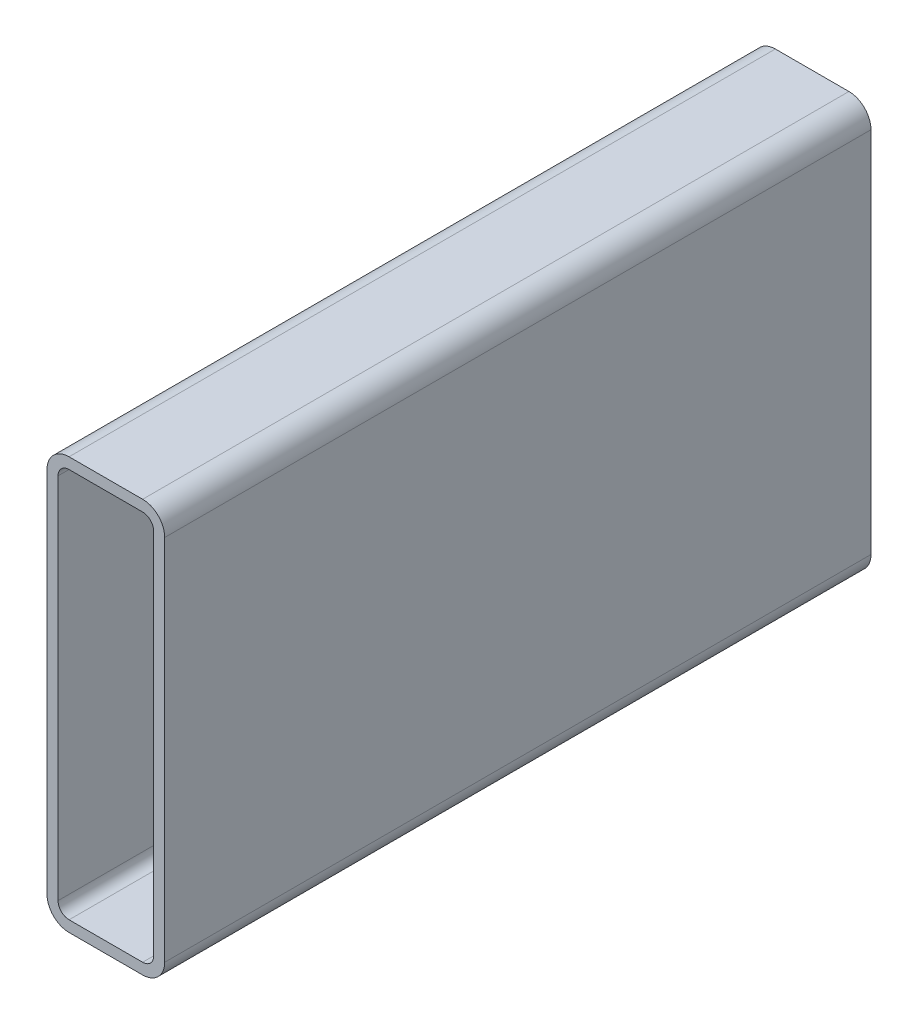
ISO-10303-21;
HEADER;
FILE_DESCRIPTION(('STEP AP214'),'2;1');
FILE_NAME('part.step','',(''),(''),'','','');
FILE_SCHEMA(('AUTOMOTIVE_DESIGN { 1 0 10303 214 1 1 1 1 }'));
ENDSEC;
DATA;
#1=APPLICATION_CONTEXT('core data for automotive mechanical design processes');
#2=APPLICATION_PROTOCOL_DEFINITION('international standard','automotive_design',2000,#1);
#3=PRODUCT_CONTEXT('',#1,'mechanical');
#4=PRODUCT('Part','Part','',(#3));
#5=PRODUCT_RELATED_PRODUCT_CATEGORY('part','',(#4));
#6=PRODUCT_DEFINITION_FORMATION('','',#4);
#7=PRODUCT_DEFINITION_CONTEXT('part definition',#1,'design');
#8=PRODUCT_DEFINITION('design','',#6,#7);
#9=PRODUCT_DEFINITION_SHAPE('','',#8);
#10=(LENGTH_UNIT() NAMED_UNIT(*) SI_UNIT(.MILLI.,.METRE.));
#11=(NAMED_UNIT(*) PLANE_ANGLE_UNIT() SI_UNIT($,.RADIAN.));
#12=(NAMED_UNIT(*) SI_UNIT($,.STERADIAN.) SOLID_ANGLE_UNIT());
#13=UNCERTAINTY_MEASURE_WITH_UNIT(LENGTH_MEASURE(1.E-05),#10,'distance_accuracy_value','');
#14=(GEOMETRIC_REPRESENTATION_CONTEXT(3) GLOBAL_UNCERTAINTY_ASSIGNED_CONTEXT((#13)) GLOBAL_UNIT_ASSIGNED_CONTEXT((#10,
#11,#12)) REPRESENTATION_CONTEXT('',''));
#15=CARTESIAN_POINT('',(0.,0.,0.));
#16=DIRECTION('',(0.,0.,1.));
#17=DIRECTION('',(1.,0.,0.));
#18=AXIS2_PLACEMENT_3D('',#15,#16,#17);
#19=CARTESIAN_POINT('',(9.52500000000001,168.275,304.8));
#20=DIRECTION('',(0.,0.,1.));
#21=DIRECTION('',(1.,0.,0.));
#22=AXIS2_PLACEMENT_3D('',#19,#20,#21);
#23=PLANE('',#22);
#24=CARTESIAN_POINT('',(9.52500000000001,168.275,304.8));
#25=DIRECTION('',(0.,0.,1.));
#26=DIRECTION('',(1.,0.,0.));
#27=AXIS2_PLACEMENT_3D('',#24,#25,#26);
#28=CIRCLE('',#27,9.52500000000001);
#29=CARTESIAN_POINT('',(9.525,177.8,304.8));
#30=VERTEX_POINT('',#29);
#31=CARTESIAN_POINT('',(0.,168.275,304.8));
#32=VERTEX_POINT('',#31);
#33=EDGE_CURVE('E211',#30,#32,#28,.T.);
#34=ORIENTED_EDGE('',*,*,#33,.T.);
#35=DIRECTION('',(0.,-1.,0.));
#36=VECTOR('',#35,1.);
#37=CARTESIAN_POINT('',(0.,9.525,304.8));
#38=LINE('',#37,#36);
#39=CARTESIAN_POINT('',(0.,9.525,304.8));
#40=VERTEX_POINT('',#39);
#41=EDGE_CURVE('E214',#32,#40,#38,.T.);
#42=ORIENTED_EDGE('',*,*,#41,.T.);
#43=CARTESIAN_POINT('',(9.525,9.525,304.8));
#44=DIRECTION('',(0.,0.,1.));
#45=DIRECTION('',(1.,0.,0.));
#46=AXIS2_PLACEMENT_3D('',#43,#44,#45);
#47=CIRCLE('',#46,9.525);
#48=CARTESIAN_POINT('',(9.525,0.,304.8));
#49=VERTEX_POINT('',#48);
#50=EDGE_CURVE('E217',#40,#49,#47,.T.);
#51=ORIENTED_EDGE('',*,*,#50,.T.);
#52=DIRECTION('',(1.,0.,0.));
#53=VECTOR('',#52,1.);
#54=CARTESIAN_POINT('',(41.275,0.,304.8));
#55=LINE('',#54,#53);
#56=CARTESIAN_POINT('',(41.275,0.,304.8));
#57=VERTEX_POINT('',#56);
#58=EDGE_CURVE('E219',#49,#57,#55,.T.);
#59=ORIENTED_EDGE('',*,*,#58,.T.);
#60=CARTESIAN_POINT('',(41.275,9.525,304.8));
#61=DIRECTION('',(0.,0.,1.));
#62=DIRECTION('',(1.,0.,0.));
#63=AXIS2_PLACEMENT_3D('',#60,#61,#62);
#64=CIRCLE('',#63,9.525);
#65=CARTESIAN_POINT('',(50.8,9.525,304.8));
#66=VERTEX_POINT('',#65);
#67=EDGE_CURVE('E221',#57,#66,#64,.T.);
#68=ORIENTED_EDGE('',*,*,#67,.T.);
#69=DIRECTION('',(0.,1.,0.));
#70=VECTOR('',#69,1.);
#71=CARTESIAN_POINT('',(50.8,168.275,304.8));
#72=LINE('',#71,#70);
#73=CARTESIAN_POINT('',(50.8,168.275,304.8));
#74=VERTEX_POINT('',#73);
#75=EDGE_CURVE('E223',#66,#74,#72,.T.);
#76=ORIENTED_EDGE('',*,*,#75,.T.);
#77=CARTESIAN_POINT('',(41.275,168.275,304.8));
#78=DIRECTION('',(0.,0.,1.));
#79=DIRECTION('',(1.,0.,0.));
#80=AXIS2_PLACEMENT_3D('',#77,#78,#79);
#81=CIRCLE('',#80,9.525);
#82=CARTESIAN_POINT('',(41.275,177.8,304.8));
#83=VERTEX_POINT('',#82);
#84=EDGE_CURVE('E225',#74,#83,#81,.T.);
#85=ORIENTED_EDGE('',*,*,#84,.T.);
#86=DIRECTION('',(-1.,0.,0.));
#87=VECTOR('',#86,1.);
#88=CARTESIAN_POINT('',(9.525,177.8,304.8));
#89=LINE('',#88,#87);
#90=EDGE_CURVE('E227',#83,#30,#89,.T.);
#91=ORIENTED_EDGE('',*,*,#90,.T.);
#92=EDGE_LOOP('',(#34,#42,#51,#59,#68,#76,#85,#91));
#93=FACE_BOUND('',#92,.T.);
#94=DIRECTION('',(0.,-1.,0.));
#95=VECTOR('',#94,1.);
#96=CARTESIAN_POINT('',(4.7625,9.525,304.8));
#97=LINE('',#96,#95);
#98=CARTESIAN_POINT('',(4.7625,168.275,304.8));
#99=VERTEX_POINT('',#98);
#100=CARTESIAN_POINT('',(4.7625,9.525,304.8));
#101=VERTEX_POINT('',#100);
#102=EDGE_CURVE('E154',#99,#101,#97,.T.);
#103=ORIENTED_EDGE('',*,*,#102,.F.);
#104=CARTESIAN_POINT('',(9.52500000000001,168.275,304.8));
#105=DIRECTION('',(0.,0.,1.));
#106=DIRECTION('',(1.,0.,0.));
#107=AXIS2_PLACEMENT_3D('',#104,#105,#106);
#108=CIRCLE('',#107,4.7625);
#109=CARTESIAN_POINT('',(9.525,173.0375,304.8));
#110=VERTEX_POINT('',#109);
#111=EDGE_CURVE('E146',#110,#99,#108,.T.);
#112=ORIENTED_EDGE('',*,*,#111,.F.);
#113=DIRECTION('',(-1.,0.,0.));
#114=VECTOR('',#113,1.);
#115=CARTESIAN_POINT('',(9.525,173.0375,304.8));
#116=LINE('',#115,#114);
#117=CARTESIAN_POINT('',(41.275,173.0375,304.8));
#118=VERTEX_POINT('',#117);
#119=EDGE_CURVE('E179',#118,#110,#116,.T.);
#120=ORIENTED_EDGE('',*,*,#119,.F.);
#121=CARTESIAN_POINT('',(41.275,168.275,304.8));
#122=DIRECTION('',(0.,0.,1.));
#123=DIRECTION('',(1.,0.,0.));
#124=AXIS2_PLACEMENT_3D('',#121,#122,#123);
#125=CIRCLE('',#124,4.7625);
#126=CARTESIAN_POINT('',(46.0375,168.275,304.8));
#127=VERTEX_POINT('',#126);
#128=EDGE_CURVE('E177',#127,#118,#125,.T.);
#129=ORIENTED_EDGE('',*,*,#128,.F.);
#130=DIRECTION('',(0.,1.,0.));
#131=VECTOR('',#130,1.);
#132=CARTESIAN_POINT('',(46.0375,168.275,304.8));
#133=LINE('',#132,#131);
#134=CARTESIAN_POINT('',(46.0375,9.525,304.8));
#135=VERTEX_POINT('',#134);
#136=EDGE_CURVE('E175',#135,#127,#133,.T.);
#137=ORIENTED_EDGE('',*,*,#136,.F.);
#138=CARTESIAN_POINT('',(41.275,9.525,304.8));
#139=DIRECTION('',(0.,0.,1.));
#140=DIRECTION('',(1.,0.,0.));
#141=AXIS2_PLACEMENT_3D('',#138,#139,#140);
#142=CIRCLE('',#141,4.7625);
#143=CARTESIAN_POINT('',(41.275,4.7625,304.8));
#144=VERTEX_POINT('',#143);
#145=EDGE_CURVE('E173',#144,#135,#142,.T.);
#146=ORIENTED_EDGE('',*,*,#145,.F.);
#147=DIRECTION('',(1.,0.,0.));
#148=VECTOR('',#147,1.);
#149=CARTESIAN_POINT('',(41.275,4.7625,304.8));
#150=LINE('',#149,#148);
#151=CARTESIAN_POINT('',(9.525,4.7625,304.8));
#152=VERTEX_POINT('',#151);
#153=EDGE_CURVE('E169',#152,#144,#150,.T.);
#154=ORIENTED_EDGE('',*,*,#153,.F.);
#155=CARTESIAN_POINT('',(9.525,9.525,304.8));
#156=DIRECTION('',(0.,0.,1.));
#157=DIRECTION('',(1.,0.,0.));
#158=AXIS2_PLACEMENT_3D('',#155,#156,#157);
#159=CIRCLE('',#158,4.7625);
#160=EDGE_CURVE('E167',#101,#152,#159,.T.);
#161=ORIENTED_EDGE('',*,*,#160,.F.);
#162=EDGE_LOOP('',(#103,#112,#120,#129,#137,#146,#154,#161));
#163=FACE_BOUND('',#162,.T.);
#164=ADVANCED_FACE('F33',(#93,#163),#23,.T.);
#165=CARTESIAN_POINT('',(9.52500000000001,168.275,0.));
#166=DIRECTION('',(0.,0.,1.));
#167=DIRECTION('',(1.,0.,0.));
#168=AXIS2_PLACEMENT_3D('',#165,#166,#167);
#169=PLANE('',#168);
#170=CARTESIAN_POINT('',(9.52500000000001,168.275,0.));
#171=DIRECTION('',(0.,0.,1.));
#172=DIRECTION('',(1.,0.,0.));
#173=AXIS2_PLACEMENT_3D('',#170,#171,#172);
#174=CIRCLE('',#173,9.52500000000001);
#175=CARTESIAN_POINT('',(9.525,177.8,0.));
#176=VERTEX_POINT('',#175);
#177=CARTESIAN_POINT('',(0.,168.275,0.));
#178=VERTEX_POINT('',#177);
#179=EDGE_CURVE('E162',#176,#178,#174,.T.);
#180=ORIENTED_EDGE('',*,*,#179,.F.);
#181=DIRECTION('',(-1.,0.,0.));
#182=VECTOR('',#181,1.);
#183=CARTESIAN_POINT('',(9.525,177.8,0.));
#184=LINE('',#183,#182);
#185=CARTESIAN_POINT('',(41.275,177.8,0.));
#186=VERTEX_POINT('',#185);
#187=EDGE_CURVE('E215',#186,#176,#184,.T.);
#188=ORIENTED_EDGE('',*,*,#187,.F.);
#189=CARTESIAN_POINT('',(41.275,168.275,0.));
#190=DIRECTION('',(0.,0.,1.));
#191=DIRECTION('',(1.,0.,0.));
#192=AXIS2_PLACEMENT_3D('',#189,#190,#191);
#193=CIRCLE('',#192,9.525);
#194=CARTESIAN_POINT('',(50.8,168.275,0.));
#195=VERTEX_POINT('',#194);
#196=EDGE_CURVE('E242',#195,#186,#193,.T.);
#197=ORIENTED_EDGE('',*,*,#196,.F.);
#198=DIRECTION('',(0.,1.,0.));
#199=VECTOR('',#198,1.);
#200=CARTESIAN_POINT('',(50.8,168.275,0.));
#201=LINE('',#200,#199);
#202=CARTESIAN_POINT('',(50.8,9.525,0.));
#203=VERTEX_POINT('',#202);
#204=EDGE_CURVE('E240',#203,#195,#201,.T.);
#205=ORIENTED_EDGE('',*,*,#204,.F.);
#206=CARTESIAN_POINT('',(41.275,9.525,0.));
#207=DIRECTION('',(0.,0.,1.));
#208=DIRECTION('',(1.,0.,0.));
#209=AXIS2_PLACEMENT_3D('',#206,#207,#208);
#210=CIRCLE('',#209,9.525);
#211=CARTESIAN_POINT('',(41.275,0.,0.));
#212=VERTEX_POINT('',#211);
#213=EDGE_CURVE('E238',#212,#203,#210,.T.);
#214=ORIENTED_EDGE('',*,*,#213,.F.);
#215=DIRECTION('',(1.,0.,0.));
#216=VECTOR('',#215,1.);
#217=CARTESIAN_POINT('',(41.275,0.,0.));
#218=LINE('',#217,#216);
#219=CARTESIAN_POINT('',(9.525,0.,0.));
#220=VERTEX_POINT('',#219);
#221=EDGE_CURVE('E236',#220,#212,#218,.T.);
#222=ORIENTED_EDGE('',*,*,#221,.F.);
#223=CARTESIAN_POINT('',(9.525,9.525,0.));
#224=DIRECTION('',(0.,0.,1.));
#225=DIRECTION('',(1.,0.,0.));
#226=AXIS2_PLACEMENT_3D('',#223,#224,#225);
#227=CIRCLE('',#226,9.525);
#228=CARTESIAN_POINT('',(0.,9.525,0.));
#229=VERTEX_POINT('',#228);
#230=EDGE_CURVE('E234',#229,#220,#227,.T.);
#231=ORIENTED_EDGE('',*,*,#230,.F.);
#232=DIRECTION('',(0.,-1.,0.));
#233=VECTOR('',#232,1.);
#234=CARTESIAN_POINT('',(0.,9.525,0.));
#235=LINE('',#234,#233);
#236=EDGE_CURVE('E232',#178,#229,#235,.T.);
#237=ORIENTED_EDGE('',*,*,#236,.F.);
#238=EDGE_LOOP('',(#180,#188,#197,#205,#214,#222,#231,#237));
#239=FACE_BOUND('',#238,.T.);
#240=CARTESIAN_POINT('',(9.52500000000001,168.275,0.));
#241=DIRECTION('',(0.,0.,1.));
#242=DIRECTION('',(1.,0.,0.));
#243=AXIS2_PLACEMENT_3D('',#240,#241,#242);
#244=CIRCLE('',#243,4.7625);
#245=CARTESIAN_POINT('',(9.525,173.0375,0.));
#246=VERTEX_POINT('',#245);
#247=CARTESIAN_POINT('',(4.7625,168.275,0.));
#248=VERTEX_POINT('',#247);
#249=EDGE_CURVE('E56',#246,#248,#244,.T.);
#250=ORIENTED_EDGE('',*,*,#249,.T.);
#251=DIRECTION('',(0.,-1.,0.));
#252=VECTOR('',#251,1.);
#253=CARTESIAN_POINT('',(4.7625,9.525,0.));
#254=LINE('',#253,#252);
#255=CARTESIAN_POINT('',(4.7625,9.525,0.));
#256=VERTEX_POINT('',#255);
#257=EDGE_CURVE('E161',#248,#256,#254,.T.);
#258=ORIENTED_EDGE('',*,*,#257,.T.);
#259=CARTESIAN_POINT('',(9.525,9.525,0.));
#260=DIRECTION('',(0.,0.,1.));
#261=DIRECTION('',(1.,0.,0.));
#262=AXIS2_PLACEMENT_3D('',#259,#260,#261);
#263=CIRCLE('',#262,4.7625);
#264=CARTESIAN_POINT('',(9.525,4.7625,0.));
#265=VERTEX_POINT('',#264);
#266=EDGE_CURVE('E183',#256,#265,#263,.T.);
#267=ORIENTED_EDGE('',*,*,#266,.T.);
#268=DIRECTION('',(1.,0.,0.));
#269=VECTOR('',#268,1.);
#270=CARTESIAN_POINT('',(41.275,4.7625,0.));
#271=LINE('',#270,#269);
#272=CARTESIAN_POINT('',(41.275,4.7625,0.));
#273=VERTEX_POINT('',#272);
#274=EDGE_CURVE('E186',#265,#273,#271,.T.);
#275=ORIENTED_EDGE('',*,*,#274,.T.);
#276=CARTESIAN_POINT('',(41.275,9.525,0.));
#277=DIRECTION('',(0.,0.,1.));
#278=DIRECTION('',(1.,0.,0.));
#279=AXIS2_PLACEMENT_3D('',#276,#277,#278);
#280=CIRCLE('',#279,4.7625);
#281=CARTESIAN_POINT('',(46.0375,9.525,0.));
#282=VERTEX_POINT('',#281);
#283=EDGE_CURVE('E189',#273,#282,#280,.T.);
#284=ORIENTED_EDGE('',*,*,#283,.T.);
#285=DIRECTION('',(0.,1.,0.));
#286=VECTOR('',#285,1.);
#287=CARTESIAN_POINT('',(46.0375,168.275,0.));
#288=LINE('',#287,#286);
#289=CARTESIAN_POINT('',(46.0375,168.275,0.));
#290=VERTEX_POINT('',#289);
#291=EDGE_CURVE('E192',#282,#290,#288,.T.);
#292=ORIENTED_EDGE('',*,*,#291,.T.);
#293=CARTESIAN_POINT('',(41.275,168.275,0.));
#294=DIRECTION('',(0.,0.,1.));
#295=DIRECTION('',(1.,0.,0.));
#296=AXIS2_PLACEMENT_3D('',#293,#294,#295);
#297=CIRCLE('',#296,4.7625);
#298=CARTESIAN_POINT('',(41.275,173.0375,0.));
#299=VERTEX_POINT('',#298);
#300=EDGE_CURVE('E195',#290,#299,#297,.T.);
#301=ORIENTED_EDGE('',*,*,#300,.T.);
#302=DIRECTION('',(-1.,0.,0.));
#303=VECTOR('',#302,1.);
#304=CARTESIAN_POINT('',(9.525,173.0375,0.));
#305=LINE('',#304,#303);
#306=EDGE_CURVE('E155',#299,#246,#305,.T.);
#307=ORIENTED_EDGE('',*,*,#306,.T.);
#308=EDGE_LOOP('',(#250,#258,#267,#275,#284,#292,#301,#307));
#309=FACE_BOUND('',#308,.T.);
#310=ADVANCED_FACE('F272',(#239,#309),#169,.F.);
#311=CARTESIAN_POINT('',(9.52500000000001,168.275,304.8));
#312=DIRECTION('',(0.,0.,-1.));
#313=DIRECTION('',(-1.,0.,0.));
#314=AXIS2_PLACEMENT_3D('',#311,#312,#313);
#315=CYLINDRICAL_SURFACE('',#314,9.52500000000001);
#316=ORIENTED_EDGE('',*,*,#179,.T.);
#317=DIRECTION('',(0.,0.,-1.));
#318=VECTOR('',#317,1.);
#319=CARTESIAN_POINT('',(0.,168.275,304.8));
#320=LINE('',#319,#318);
#321=EDGE_CURVE('E11',#32,#178,#320,.T.);
#322=ORIENTED_EDGE('',*,*,#321,.F.);
#323=ORIENTED_EDGE('',*,*,#33,.F.);
#324=DIRECTION('',(0.,0.,-1.));
#325=VECTOR('',#324,1.);
#326=CARTESIAN_POINT('',(9.525,177.8,304.8));
#327=LINE('',#326,#325);
#328=EDGE_CURVE('E229',#30,#176,#327,.T.);
#329=ORIENTED_EDGE('',*,*,#328,.T.);
#330=EDGE_LOOP('',(#316,#322,#323,#329));
#331=FACE_BOUND('',#330,.T.);
#332=ADVANCED_FACE('F35',(#331),#315,.T.);
#333=CARTESIAN_POINT('',(0.,9.525,304.8));
#334=DIRECTION('',(1.,0.,0.));
#335=DIRECTION('',(0.,0.,-1.));
#336=AXIS2_PLACEMENT_3D('',#333,#334,#335);
#337=PLANE('',#336);
#338=ORIENTED_EDGE('',*,*,#236,.T.);
#339=DIRECTION('',(0.,0.,-1.));
#340=VECTOR('',#339,1.);
#341=CARTESIAN_POINT('',(0.,9.525,304.8));
#342=LINE('',#341,#340);
#343=EDGE_CURVE('E41',#40,#229,#342,.T.);
#344=ORIENTED_EDGE('',*,*,#343,.F.);
#345=ORIENTED_EDGE('',*,*,#41,.F.);
#346=ORIENTED_EDGE('',*,*,#321,.T.);
#347=EDGE_LOOP('',(#338,#344,#345,#346));
#348=FACE_BOUND('',#347,.T.);
#349=ADVANCED_FACE('F289',(#348),#337,.F.);
#350=CARTESIAN_POINT('',(9.525,9.525,304.8));
#351=DIRECTION('',(0.,0.,-1.));
#352=DIRECTION('',(-1.,0.,0.));
#353=AXIS2_PLACEMENT_3D('',#350,#351,#352);
#354=CYLINDRICAL_SURFACE('',#353,9.525);
#355=ORIENTED_EDGE('',*,*,#230,.T.);
#356=DIRECTION('',(0.,0.,-1.));
#357=VECTOR('',#356,1.);
#358=CARTESIAN_POINT('',(9.525,0.,304.8));
#359=LINE('',#358,#357);
#360=EDGE_CURVE('E259',#49,#220,#359,.T.);
#361=ORIENTED_EDGE('',*,*,#360,.F.);
#362=ORIENTED_EDGE('',*,*,#50,.F.);
#363=ORIENTED_EDGE('',*,*,#343,.T.);
#364=EDGE_LOOP('',(#355,#361,#362,#363));
#365=FACE_BOUND('',#364,.T.);
#366=ADVANCED_FACE('F266',(#365),#354,.T.);
#367=CARTESIAN_POINT('',(41.275,0.,304.8));
#368=DIRECTION('',(0.,1.,0.));
#369=DIRECTION('',(0.,0.,1.));
#370=AXIS2_PLACEMENT_3D('',#367,#368,#369);
#371=PLANE('',#370);
#372=ORIENTED_EDGE('',*,*,#221,.T.);
#373=DIRECTION('',(0.,0.,-1.));
#374=VECTOR('',#373,1.);
#375=CARTESIAN_POINT('',(41.275,0.,304.8));
#376=LINE('',#375,#374);
#377=EDGE_CURVE('E256',#57,#212,#376,.T.);
#378=ORIENTED_EDGE('',*,*,#377,.F.);
#379=ORIENTED_EDGE('',*,*,#58,.F.);
#380=ORIENTED_EDGE('',*,*,#360,.T.);
#381=EDGE_LOOP('',(#372,#378,#379,#380));
#382=FACE_BOUND('',#381,.T.);
#383=ADVANCED_FACE('F278',(#382),#371,.F.);
#384=CARTESIAN_POINT('',(41.275,9.525,304.8));
#385=DIRECTION('',(0.,0.,-1.));
#386=DIRECTION('',(-1.,0.,0.));
#387=AXIS2_PLACEMENT_3D('',#384,#385,#386);
#388=CYLINDRICAL_SURFACE('',#387,9.525);
#389=ORIENTED_EDGE('',*,*,#213,.T.);
#390=DIRECTION('',(0.,0.,-1.));
#391=VECTOR('',#390,1.);
#392=CARTESIAN_POINT('',(50.8,9.525,304.8));
#393=LINE('',#392,#391);
#394=EDGE_CURVE('E253',#66,#203,#393,.T.);
#395=ORIENTED_EDGE('',*,*,#394,.F.);
#396=ORIENTED_EDGE('',*,*,#67,.F.);
#397=ORIENTED_EDGE('',*,*,#377,.T.);
#398=EDGE_LOOP('',(#389,#395,#396,#397));
#399=FACE_BOUND('',#398,.T.);
#400=ADVANCED_FACE('F282',(#399),#388,.T.);
#401=CARTESIAN_POINT('',(50.8,168.275,304.8));
#402=DIRECTION('',(-1.,0.,0.));
#403=DIRECTION('',(0.,0.,1.));
#404=AXIS2_PLACEMENT_3D('',#401,#402,#403);
#405=PLANE('',#404);
#406=ORIENTED_EDGE('',*,*,#204,.T.);
#407=DIRECTION('',(0.,0.,-1.));
#408=VECTOR('',#407,1.);
#409=CARTESIAN_POINT('',(50.8,168.275,304.8));
#410=LINE('',#409,#408);
#411=EDGE_CURVE('E250',#74,#195,#410,.T.);
#412=ORIENTED_EDGE('',*,*,#411,.F.);
#413=ORIENTED_EDGE('',*,*,#75,.F.);
#414=ORIENTED_EDGE('',*,*,#394,.T.);
#415=EDGE_LOOP('',(#406,#412,#413,#414));
#416=FACE_BOUND('',#415,.T.);
#417=ADVANCED_FACE('F302',(#416),#405,.F.);
#418=CARTESIAN_POINT('',(41.275,168.275,304.8));
#419=DIRECTION('',(0.,0.,-1.));
#420=DIRECTION('',(-1.,0.,0.));
#421=AXIS2_PLACEMENT_3D('',#418,#419,#420);
#422=CYLINDRICAL_SURFACE('',#421,9.525);
#423=ORIENTED_EDGE('',*,*,#196,.T.);
#424=DIRECTION('',(0.,0.,-1.));
#425=VECTOR('',#424,1.);
#426=CARTESIAN_POINT('',(41.275,177.8,304.8));
#427=LINE('',#426,#425);
#428=EDGE_CURVE('E247',#83,#186,#427,.T.);
#429=ORIENTED_EDGE('',*,*,#428,.F.);
#430=ORIENTED_EDGE('',*,*,#84,.F.);
#431=ORIENTED_EDGE('',*,*,#411,.T.);
#432=EDGE_LOOP('',(#423,#429,#430,#431));
#433=FACE_BOUND('',#432,.T.);
#434=ADVANCED_FACE('F300',(#433),#422,.T.);
#435=CARTESIAN_POINT('',(9.525,177.8,304.8));
#436=DIRECTION('',(0.,-1.,0.));
#437=DIRECTION('',(0.,0.,-1.));
#438=AXIS2_PLACEMENT_3D('',#435,#436,#437);
#439=PLANE('',#438);
#440=ORIENTED_EDGE('',*,*,#187,.T.);
#441=ORIENTED_EDGE('',*,*,#328,.F.);
#442=ORIENTED_EDGE('',*,*,#90,.F.);
#443=ORIENTED_EDGE('',*,*,#428,.T.);
#444=EDGE_LOOP('',(#440,#441,#442,#443));
#445=FACE_BOUND('',#444,.T.);
#446=ADVANCED_FACE('F295',(#445),#439,.F.);
#447=CARTESIAN_POINT('',(9.52500000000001,168.275,304.8));
#448=DIRECTION('',(0.,0.,-1.));
#449=DIRECTION('',(-1.,0.,0.));
#450=AXIS2_PLACEMENT_3D('',#447,#448,#449);
#451=CYLINDRICAL_SURFACE('',#450,4.7625);
#452=ORIENTED_EDGE('',*,*,#249,.F.);
#453=DIRECTION('',(0.,0.,-1.));
#454=VECTOR('',#453,1.);
#455=CARTESIAN_POINT('',(9.525,173.0375,304.8));
#456=LINE('',#455,#454);
#457=EDGE_CURVE('E150',#110,#246,#456,.T.);
#458=ORIENTED_EDGE('',*,*,#457,.F.);
#459=ORIENTED_EDGE('',*,*,#111,.T.);
#460=DIRECTION('',(0.,0.,-1.));
#461=VECTOR('',#460,1.);
#462=CARTESIAN_POINT('',(4.7625,168.275,304.8));
#463=LINE('',#462,#461);
#464=EDGE_CURVE('E149',#99,#248,#463,.T.);
#465=ORIENTED_EDGE('',*,*,#464,.T.);
#466=EDGE_LOOP('',(#452,#458,#459,#465));
#467=FACE_BOUND('',#466,.T.);
#468=ADVANCED_FACE('F148',(#467),#451,.F.);
#469=CARTESIAN_POINT('',(4.7625,9.525,304.8));
#470=DIRECTION('',(1.,0.,0.));
#471=DIRECTION('',(0.,0.,-1.));
#472=AXIS2_PLACEMENT_3D('',#469,#470,#471);
#473=PLANE('',#472);
#474=ORIENTED_EDGE('',*,*,#257,.F.);
#475=ORIENTED_EDGE('',*,*,#464,.F.);
#476=ORIENTED_EDGE('',*,*,#102,.T.);
#477=DIRECTION('',(0.,0.,-1.));
#478=VECTOR('',#477,1.);
#479=CARTESIAN_POINT('',(4.7625,9.525,304.8));
#480=LINE('',#479,#478);
#481=EDGE_CURVE('E163',#101,#256,#480,.T.);
#482=ORIENTED_EDGE('',*,*,#481,.T.);
#483=EDGE_LOOP('',(#474,#475,#476,#482));
#484=FACE_BOUND('',#483,.T.);
#485=ADVANCED_FACE('F158',(#484),#473,.T.);
#486=CARTESIAN_POINT('',(9.525,9.525,304.8));
#487=DIRECTION('',(0.,0.,-1.));
#488=DIRECTION('',(-1.,0.,0.));
#489=AXIS2_PLACEMENT_3D('',#486,#487,#488);
#490=CYLINDRICAL_SURFACE('',#489,4.7625);
#491=ORIENTED_EDGE('',*,*,#266,.F.);
#492=ORIENTED_EDGE('',*,*,#481,.F.);
#493=ORIENTED_EDGE('',*,*,#160,.T.);
#494=DIRECTION('',(0.,0.,-1.));
#495=VECTOR('',#494,1.);
#496=CARTESIAN_POINT('',(9.525,4.7625,304.8));
#497=LINE('',#496,#495);
#498=EDGE_CURVE('E208',#152,#265,#497,.T.);
#499=ORIENTED_EDGE('',*,*,#498,.T.);
#500=EDGE_LOOP('',(#491,#492,#493,#499));
#501=FACE_BOUND('',#500,.T.);
#502=ADVANCED_FACE('F327',(#501),#490,.F.);
#503=CARTESIAN_POINT('',(41.275,4.7625,304.8));
#504=DIRECTION('',(0.,1.,0.));
#505=DIRECTION('',(0.,0.,1.));
#506=AXIS2_PLACEMENT_3D('',#503,#504,#505);
#507=PLANE('',#506);
#508=ORIENTED_EDGE('',*,*,#274,.F.);
#509=ORIENTED_EDGE('',*,*,#498,.F.);
#510=ORIENTED_EDGE('',*,*,#153,.T.);
#511=DIRECTION('',(0.,0.,-1.));
#512=VECTOR('',#511,1.);
#513=CARTESIAN_POINT('',(41.275,4.7625,304.8));
#514=LINE('',#513,#512);
#515=EDGE_CURVE('E206',#144,#273,#514,.T.);
#516=ORIENTED_EDGE('',*,*,#515,.T.);
#517=EDGE_LOOP('',(#508,#509,#510,#516));
#518=FACE_BOUND('',#517,.T.);
#519=ADVANCED_FACE('F331',(#518),#507,.T.);
#520=CARTESIAN_POINT('',(41.275,9.525,304.8));
#521=DIRECTION('',(0.,0.,-1.));
#522=DIRECTION('',(-1.,0.,0.));
#523=AXIS2_PLACEMENT_3D('',#520,#521,#522);
#524=CYLINDRICAL_SURFACE('',#523,4.7625);
#525=ORIENTED_EDGE('',*,*,#283,.F.);
#526=ORIENTED_EDGE('',*,*,#515,.F.);
#527=ORIENTED_EDGE('',*,*,#145,.T.);
#528=DIRECTION('',(0.,0.,-1.));
#529=VECTOR('',#528,1.);
#530=CARTESIAN_POINT('',(46.0375,9.525,304.8));
#531=LINE('',#530,#529);
#532=EDGE_CURVE('E204',#135,#282,#531,.T.);
#533=ORIENTED_EDGE('',*,*,#532,.T.);
#534=EDGE_LOOP('',(#525,#526,#527,#533));
#535=FACE_BOUND('',#534,.T.);
#536=ADVANCED_FACE('F337',(#535),#524,.F.);
#537=CARTESIAN_POINT('',(46.0375,168.275,304.8));
#538=DIRECTION('',(-1.,0.,0.));
#539=DIRECTION('',(0.,0.,1.));
#540=AXIS2_PLACEMENT_3D('',#537,#538,#539);
#541=PLANE('',#540);
#542=ORIENTED_EDGE('',*,*,#291,.F.);
#543=ORIENTED_EDGE('',*,*,#532,.F.);
#544=ORIENTED_EDGE('',*,*,#136,.T.);
#545=DIRECTION('',(0.,0.,-1.));
#546=VECTOR('',#545,1.);
#547=CARTESIAN_POINT('',(46.0375,168.275,304.8));
#548=LINE('',#547,#546);
#549=EDGE_CURVE('E202',#127,#290,#548,.T.);
#550=ORIENTED_EDGE('',*,*,#549,.T.);
#551=EDGE_LOOP('',(#542,#543,#544,#550));
#552=FACE_BOUND('',#551,.T.);
#553=ADVANCED_FACE('F341',(#552),#541,.T.);
#554=CARTESIAN_POINT('',(41.275,168.275,304.8));
#555=DIRECTION('',(0.,0.,-1.));
#556=DIRECTION('',(-1.,0.,0.));
#557=AXIS2_PLACEMENT_3D('',#554,#555,#556);
#558=CYLINDRICAL_SURFACE('',#557,4.7625);
#559=ORIENTED_EDGE('',*,*,#300,.F.);
#560=ORIENTED_EDGE('',*,*,#549,.F.);
#561=ORIENTED_EDGE('',*,*,#128,.T.);
#562=DIRECTION('',(0.,0.,-1.));
#563=VECTOR('',#562,1.);
#564=CARTESIAN_POINT('',(41.275,173.0375,304.8));
#565=LINE('',#564,#563);
#566=EDGE_CURVE('E48',#118,#299,#565,.T.);
#567=ORIENTED_EDGE('',*,*,#566,.T.);
#568=EDGE_LOOP('',(#559,#560,#561,#567));
#569=FACE_BOUND('',#568,.T.);
#570=ADVANCED_FACE('F345',(#569),#558,.F.);
#571=CARTESIAN_POINT('',(9.525,173.0375,304.8));
#572=DIRECTION('',(0.,-1.,0.));
#573=DIRECTION('',(0.,0.,-1.));
#574=AXIS2_PLACEMENT_3D('',#571,#572,#573);
#575=PLANE('',#574);
#576=ORIENTED_EDGE('',*,*,#306,.F.);
#577=ORIENTED_EDGE('',*,*,#566,.F.);
#578=ORIENTED_EDGE('',*,*,#119,.T.);
#579=ORIENTED_EDGE('',*,*,#457,.T.);
#580=EDGE_LOOP('',(#576,#577,#578,#579));
#581=FACE_BOUND('',#580,.T.);
#582=ADVANCED_FACE('F349',(#581),#575,.T.);
#583=CLOSED_SHELL('',(#164,#310,#332,#349,#366,#383,#400,#417,#434,#446,#468,#485,#502,#519,
#536,#553,#570,#582));
#584=MANIFOLD_SOLID_BREP('B2',#583);
#585=ADVANCED_BREP_SHAPE_REPRESENTATION('',(#18,#584),#14);
#586=SHAPE_DEFINITION_REPRESENTATION(#9,#585);
ENDSEC;
END-ISO-10303-21;
